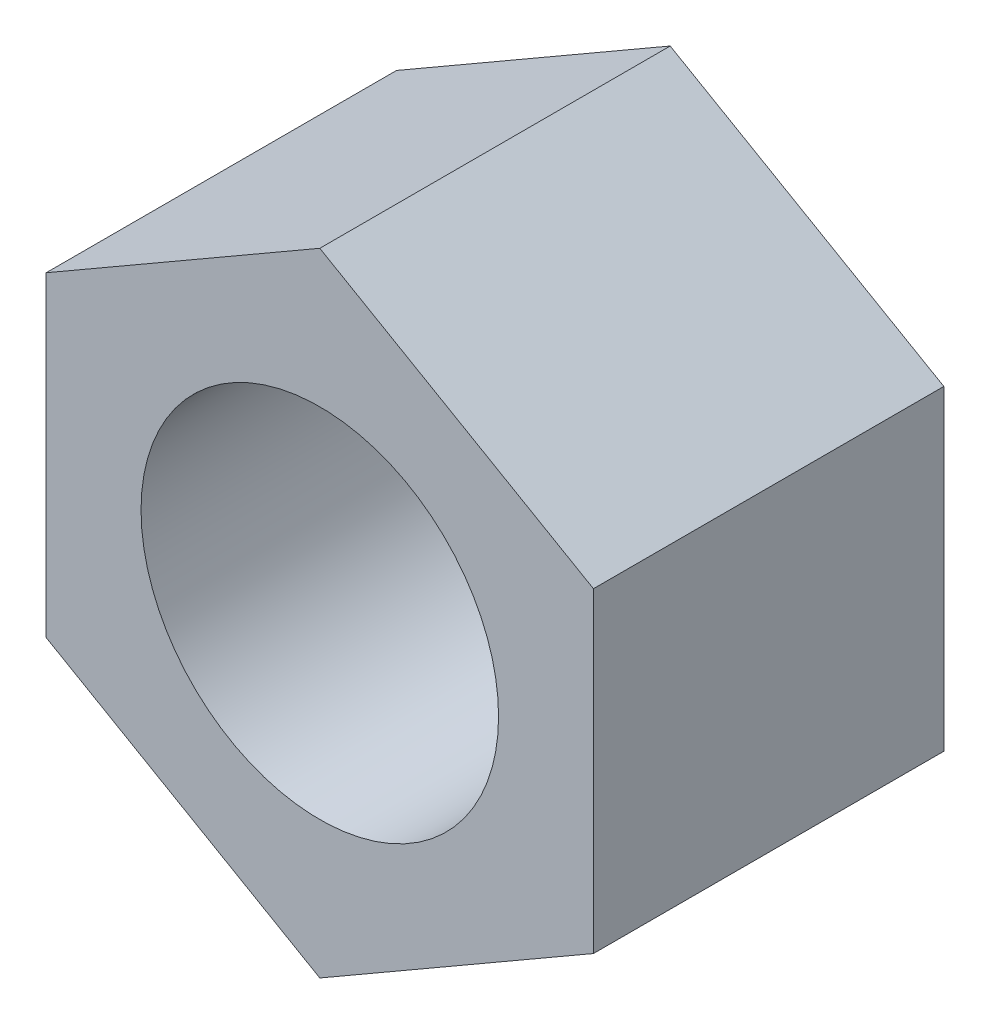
from build123d import *

# Parameters (mm, degrees)
SKETCH1_R      = 28.575
NUT_BODY_DEPTH = 56.007


with BuildPart() as part:
    # Sketch1 → Nut body (new body)
    with BuildSketch(Plane(origin=(0, 0, 0), x_dir=(0, 1, 0), z_dir=(0, 0, 1))):
        Polygon((25.252607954, -43.7388), (50.505215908, 0), (25.252607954, 43.7388), (-25.252607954, 43.7388), (-50.505215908, 0), (-25.252607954, -43.7388), align=None)
        with Locations(Location((0, 0, 0), (0, 0, 270))):
            Circle(SKETCH1_R, mode=Mode.SUBTRACT)
    extrude(amount=NUT_BODY_DEPTH)


solid = part.part
